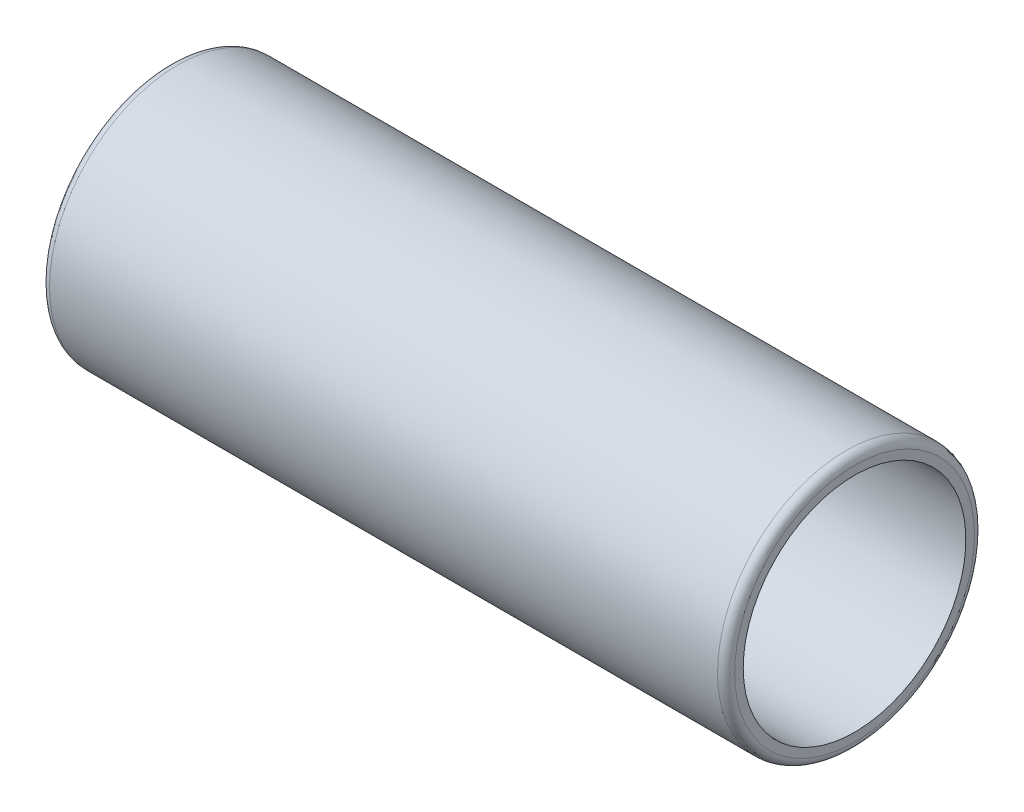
ISO-10303-21;
HEADER;
FILE_DESCRIPTION(('STEP AP214'),'2;1');
FILE_NAME('part.step','',(''),(''),'','','');
FILE_SCHEMA(('AUTOMOTIVE_DESIGN { 1 0 10303 214 1 1 1 1 }'));
ENDSEC;
DATA;
#1=APPLICATION_CONTEXT('core data for automotive mechanical design processes');
#2=APPLICATION_PROTOCOL_DEFINITION('international standard','automotive_design',2000,#1);
#3=PRODUCT_CONTEXT('',#1,'mechanical');
#4=PRODUCT('Part','Part','',(#3));
#5=PRODUCT_RELATED_PRODUCT_CATEGORY('part','',(#4));
#6=PRODUCT_DEFINITION_FORMATION('','',#4);
#7=PRODUCT_DEFINITION_CONTEXT('part definition',#1,'design');
#8=PRODUCT_DEFINITION('design','',#6,#7);
#9=PRODUCT_DEFINITION_SHAPE('','',#8);
#10=(LENGTH_UNIT() NAMED_UNIT(*) SI_UNIT(.MILLI.,.METRE.));
#11=(NAMED_UNIT(*) PLANE_ANGLE_UNIT() SI_UNIT($,.RADIAN.));
#12=(NAMED_UNIT(*) SI_UNIT($,.STERADIAN.) SOLID_ANGLE_UNIT());
#13=UNCERTAINTY_MEASURE_WITH_UNIT(LENGTH_MEASURE(1.E-05),#10,'distance_accuracy_value','');
#14=(GEOMETRIC_REPRESENTATION_CONTEXT(3) GLOBAL_UNCERTAINTY_ASSIGNED_CONTEXT((#13)) GLOBAL_UNIT_ASSIGNED_CONTEXT((#10,
#11,#12)) REPRESENTATION_CONTEXT('',''));
#15=CARTESIAN_POINT('',(0.,0.,0.));
#16=DIRECTION('',(0.,0.,1.));
#17=DIRECTION('',(1.,0.,0.));
#18=AXIS2_PLACEMENT_3D('',#15,#16,#17);
#19=CARTESIAN_POINT('',(0.,0.,0.));
#20=DIRECTION('',(-1.,0.,0.));
#21=DIRECTION('',(0.,0.,1.));
#22=AXIS2_PLACEMENT_3D('',#19,#20,#21);
#23=CYLINDRICAL_SURFACE('',#22,6.);
#24=CARTESIAN_POINT('',(6.,0.,0.));
#25=DIRECTION('',(-1.,0.,0.));
#26=DIRECTION('',(0.,0.,1.));
#27=AXIS2_PLACEMENT_3D('',#24,#25,#26);
#28=CIRCLE('',#27,6.);
#29=CARTESIAN_POINT('',(6.,0.,6.));
#30=VERTEX_POINT('',#29);
#31=EDGE_CURVE('E43',#30,#30,#28,.T.);
#32=ORIENTED_EDGE('',*,*,#31,.F.);
#33=EDGE_LOOP('',(#32));
#34=FACE_BOUND('',#33,.T.);
#35=CARTESIAN_POINT('',(0.,0.,0.));
#36=DIRECTION('',(-1.,0.,0.));
#37=DIRECTION('',(0.,0.,1.));
#38=AXIS2_PLACEMENT_3D('',#35,#36,#37);
#39=CIRCLE('',#38,6.);
#40=CARTESIAN_POINT('',(0.,0.,6.));
#41=VERTEX_POINT('',#40);
#42=EDGE_CURVE('E34',#41,#41,#39,.T.);
#43=ORIENTED_EDGE('',*,*,#42,.T.);
#44=EDGE_LOOP('',(#43));
#45=FACE_BOUND('',#44,.T.);
#46=ADVANCED_FACE('F14',(#34,#45),#23,.F.);
#47=CARTESIAN_POINT('',(0.,6.,0.));
#48=DIRECTION('',(1.,0.,0.));
#49=DIRECTION('',(0.,0.,-1.));
#50=AXIS2_PLACEMENT_3D('',#47,#48,#49);
#51=PLANE('',#50);
#52=CARTESIAN_POINT('',(0.,0.,0.));
#53=DIRECTION('',(1.,0.,0.));
#54=DIRECTION('',(0.,0.,-1.));
#55=AXIS2_PLACEMENT_3D('',#52,#53,#54);
#56=CIRCLE('',#55,14.);
#57=CARTESIAN_POINT('',(0.,0.,-14.));
#58=VERTEX_POINT('',#57);
#59=EDGE_CURVE('E21',#58,#58,#56,.F.);
#60=ORIENTED_EDGE('',*,*,#59,.T.);
#61=EDGE_LOOP('',(#60));
#62=FACE_BOUND('',#61,.T.);
#63=ORIENTED_EDGE('',*,*,#42,.F.);
#64=EDGE_LOOP('',(#63));
#65=FACE_BOUND('',#64,.T.);
#66=ADVANCED_FACE('F51',(#62,#65),#51,.F.);
#67=CARTESIAN_POINT('',(0.,0.,0.));
#68=DIRECTION('',(-1.,0.,0.));
#69=DIRECTION('',(0.,0.,1.));
#70=AXIS2_PLACEMENT_3D('',#67,#68,#69);
#71=CYLINDRICAL_SURFACE('',#70,15.);
#72=CARTESIAN_POINT('',(1.,0.,0.));
#73=DIRECTION('',(1.,0.,0.));
#74=DIRECTION('',(0.,0.,-1.));
#75=AXIS2_PLACEMENT_3D('',#72,#73,#74);
#76=CIRCLE('',#75,15.);
#77=CARTESIAN_POINT('',(1.,0.,-15.));
#78=VERTEX_POINT('',#77);
#79=EDGE_CURVE('E9',#78,#78,#76,.T.);
#80=ORIENTED_EDGE('',*,*,#79,.T.);
#81=EDGE_LOOP('',(#80));
#82=FACE_BOUND('',#81,.T.);
#83=CARTESIAN_POINT('',(79.,0.,0.));
#84=DIRECTION('',(-1.,0.,0.));
#85=DIRECTION('',(0.,0.,1.));
#86=AXIS2_PLACEMENT_3D('',#83,#84,#85);
#87=CIRCLE('',#86,15.);
#88=CARTESIAN_POINT('',(79.,0.,15.));
#89=VERTEX_POINT('',#88);
#90=EDGE_CURVE('E29',#89,#89,#87,.T.);
#91=ORIENTED_EDGE('',*,*,#90,.T.);
#92=EDGE_LOOP('',(#91));
#93=FACE_BOUND('',#92,.T.);
#94=ADVANCED_FACE('F56',(#82,#93),#71,.T.);
#95=CARTESIAN_POINT('',(80.,15.,0.));
#96=DIRECTION('',(-1.,0.,0.));
#97=DIRECTION('',(0.,0.,1.));
#98=AXIS2_PLACEMENT_3D('',#95,#96,#97);
#99=PLANE('',#98);
#100=CARTESIAN_POINT('',(80.,0.,0.));
#101=DIRECTION('',(-1.,0.,0.));
#102=DIRECTION('',(0.,0.,1.));
#103=AXIS2_PLACEMENT_3D('',#100,#101,#102);
#104=CIRCLE('',#103,14.);
#105=CARTESIAN_POINT('',(80.,0.,14.));
#106=VERTEX_POINT('',#105);
#107=EDGE_CURVE('E25',#106,#106,#104,.F.);
#108=ORIENTED_EDGE('',*,*,#107,.T.);
#109=EDGE_LOOP('',(#108));
#110=FACE_BOUND('',#109,.T.);
#111=CARTESIAN_POINT('',(80.,0.,0.));
#112=DIRECTION('',(-1.,0.,0.));
#113=DIRECTION('',(0.,0.,1.));
#114=AXIS2_PLACEMENT_3D('',#111,#112,#113);
#115=CIRCLE('',#114,13.);
#116=CARTESIAN_POINT('',(80.,0.,13.));
#117=VERTEX_POINT('',#116);
#118=EDGE_CURVE('E37',#117,#117,#115,.T.);
#119=ORIENTED_EDGE('',*,*,#118,.T.);
#120=EDGE_LOOP('',(#119));
#121=FACE_BOUND('',#120,.T.);
#122=ADVANCED_FACE('F63',(#110,#121),#99,.F.);
#123=CARTESIAN_POINT('',(0.,0.,0.));
#124=DIRECTION('',(-1.,0.,0.));
#125=DIRECTION('',(0.,0.,1.));
#126=AXIS2_PLACEMENT_3D('',#123,#124,#125);
#127=CYLINDRICAL_SURFACE('',#126,13.);
#128=ORIENTED_EDGE('',*,*,#118,.F.);
#129=EDGE_LOOP('',(#128));
#130=FACE_BOUND('',#129,.T.);
#131=CARTESIAN_POINT('',(13.,0.,0.));
#132=DIRECTION('',(-1.,0.,0.));
#133=DIRECTION('',(0.,0.,1.));
#134=AXIS2_PLACEMENT_3D('',#131,#132,#133);
#135=CIRCLE('',#134,13.);
#136=CARTESIAN_POINT('',(13.,0.,13.));
#137=VERTEX_POINT('',#136);
#138=EDGE_CURVE('E40',#137,#137,#135,.T.);
#139=ORIENTED_EDGE('',*,*,#138,.T.);
#140=EDGE_LOOP('',(#139));
#141=FACE_BOUND('',#140,.T.);
#142=ADVANCED_FACE('F75',(#130,#141),#127,.F.);
#143=CARTESIAN_POINT('',(6.,0.,0.));
#144=DIRECTION('',(1.,0.,0.));
#145=DIRECTION('',(0.,0.,-1.));
#146=AXIS2_PLACEMENT_3D('',#143,#144,#145);
#147=CONICAL_SURFACE('',#146,6.,0.785398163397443);
#148=ORIENTED_EDGE('',*,*,#138,.F.);
#149=EDGE_LOOP('',(#148));
#150=FACE_BOUND('',#149,.T.);
#151=ORIENTED_EDGE('',*,*,#31,.T.);
#152=EDGE_LOOP('',(#151));
#153=FACE_BOUND('',#152,.T.);
#154=ADVANCED_FACE('F47',(#150,#153),#147,.F.);
#155=CARTESIAN_POINT('',(79.,0.,0.));
#156=DIRECTION('',(-1.,0.,0.));
#157=DIRECTION('',(0.,0.,1.));
#158=AXIS2_PLACEMENT_3D('',#155,#156,#157);
#159=TOROIDAL_SURFACE('',#158,14.,1.);
#160=ORIENTED_EDGE('',*,*,#107,.F.);
#161=EDGE_LOOP('',(#160));
#162=FACE_BOUND('',#161,.T.);
#163=ORIENTED_EDGE('',*,*,#90,.F.);
#164=EDGE_LOOP('',(#163));
#165=FACE_BOUND('',#164,.T.);
#166=ADVANCED_FACE('F66',(#162,#165),#159,.T.);
#167=CARTESIAN_POINT('',(1.,0.,0.));
#168=DIRECTION('',(1.,0.,0.));
#169=DIRECTION('',(0.,0.,-1.));
#170=AXIS2_PLACEMENT_3D('',#167,#168,#169);
#171=TOROIDAL_SURFACE('',#170,14.,1.);
#172=ORIENTED_EDGE('',*,*,#79,.F.);
#173=EDGE_LOOP('',(#172));
#174=FACE_BOUND('',#173,.T.);
#175=ORIENTED_EDGE('',*,*,#59,.F.);
#176=EDGE_LOOP('',(#175));
#177=FACE_BOUND('',#176,.T.);
#178=ADVANCED_FACE('F16',(#174,#177),#171,.T.);
#179=CLOSED_SHELL('',(#46,#66,#94,#122,#142,#154,#166,#178));
#180=MANIFOLD_SOLID_BREP('B1',#179);
#181=ADVANCED_BREP_SHAPE_REPRESENTATION('',(#18,#180),#14);
#182=SHAPE_DEFINITION_REPRESENTATION(#9,#181);
ENDSEC;
END-ISO-10303-21;
